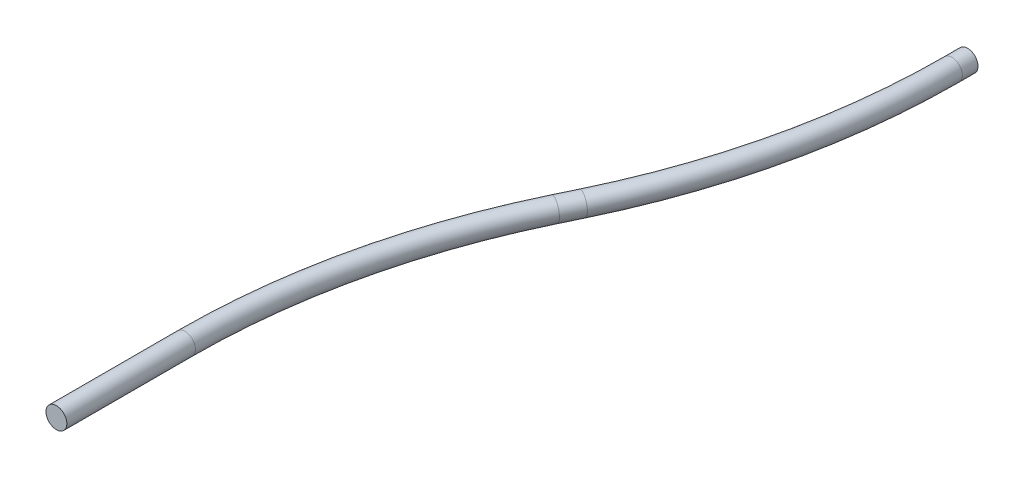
ISO-10303-21;
HEADER;
FILE_DESCRIPTION(('STEP AP214'),'2;1');
FILE_NAME('part.step','',(''),(''),'','','');
FILE_SCHEMA(('AUTOMOTIVE_DESIGN { 1 0 10303 214 1 1 1 1 }'));
ENDSEC;
DATA;
#1=APPLICATION_CONTEXT('core data for automotive mechanical design processes');
#2=APPLICATION_PROTOCOL_DEFINITION('international standard','automotive_design',2000,#1);
#3=PRODUCT_CONTEXT('',#1,'mechanical');
#4=PRODUCT('Part','Part','',(#3));
#5=PRODUCT_RELATED_PRODUCT_CATEGORY('part','',(#4));
#6=PRODUCT_DEFINITION_FORMATION('','',#4);
#7=PRODUCT_DEFINITION_CONTEXT('part definition',#1,'design');
#8=PRODUCT_DEFINITION('design','',#6,#7);
#9=PRODUCT_DEFINITION_SHAPE('','',#8);
#10=(LENGTH_UNIT() NAMED_UNIT(*) SI_UNIT(.MILLI.,.METRE.));
#11=(NAMED_UNIT(*) PLANE_ANGLE_UNIT() SI_UNIT($,.RADIAN.));
#12=(NAMED_UNIT(*) SI_UNIT($,.STERADIAN.) SOLID_ANGLE_UNIT());
#13=UNCERTAINTY_MEASURE_WITH_UNIT(LENGTH_MEASURE(1.E-05),#10,'distance_accuracy_value','');
#14=(GEOMETRIC_REPRESENTATION_CONTEXT(3) GLOBAL_UNCERTAINTY_ASSIGNED_CONTEXT((#13)) GLOBAL_UNIT_ASSIGNED_CONTEXT((#10,
#11,#12)) REPRESENTATION_CONTEXT('',''));
#15=CARTESIAN_POINT('',(0.,0.,0.));
#16=DIRECTION('',(0.,0.,1.));
#17=DIRECTION('',(1.,0.,0.));
#18=AXIS2_PLACEMENT_3D('',#15,#16,#17);
#19=CARTESIAN_POINT('',(21.336,0.,-109.481190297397));
#20=DIRECTION('',(0.,0.,-1.));
#21=DIRECTION('',(-1.,0.,0.));
#22=AXIS2_PLACEMENT_3D('',#19,#20,#21);
#23=CYLINDRICAL_SURFACE('',#22,1.524);
#24=CARTESIAN_POINT('',(21.336,0.,-109.481190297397));
#25=DIRECTION('',(0.,0.,1.));
#26=DIRECTION('',(1.,0.,0.));
#27=AXIS2_PLACEMENT_3D('',#24,#25,#26);
#28=CIRCLE('',#27,1.524);
#29=CARTESIAN_POINT('',(22.8599999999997,0.,-109.481190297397));
#30=VERTEX_POINT('',#29);
#31=EDGE_CURVE('E34',#30,#30,#28,.T.);
#32=ORIENTED_EDGE('',*,*,#31,.F.);
#33=EDGE_LOOP('',(#32));
#34=FACE_BOUND('',#33,.T.);
#35=CARTESIAN_POINT('',(21.336,0.,-111.76));
#36=DIRECTION('',(0.,0.,1.));
#37=DIRECTION('',(1.,0.,0.));
#38=AXIS2_PLACEMENT_3D('',#35,#36,#37);
#39=CIRCLE('',#38,1.524);
#40=CARTESIAN_POINT('',(22.86,0.,-111.76));
#41=VERTEX_POINT('',#40);
#42=EDGE_CURVE('E10',#41,#41,#39,.T.);
#43=ORIENTED_EDGE('',*,*,#42,.T.);
#44=EDGE_LOOP('',(#43));
#45=FACE_BOUND('',#44,.T.);
#46=ADVANCED_FACE('F28',(#34,#45),#23,.T.);
#47=CARTESIAN_POINT('',(-80.2640000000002,0.,-109.481190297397));
#48=DIRECTION('',(0.,1.,0.));
#49=DIRECTION('',(0.,0.,1.));
#50=AXIS2_PLACEMENT_3D('',#47,#48,#49);
#51=TOROIDAL_SURFACE('',#50,101.6,1.524);
#52=CARTESIAN_POINT('',(11.3307426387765,0.,-65.5157138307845));
#53=DIRECTION('',(-0.432731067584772,0.,0.901523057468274));
#54=DIRECTION('',(0.901523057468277,0.,0.432731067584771));
#55=AXIS2_PLACEMENT_3D('',#52,#53,#54);
#56=CIRCLE('',#55,1.524);
#57=CARTESIAN_POINT('',(12.704663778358,0.,-64.8562316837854));
#58=VERTEX_POINT('',#57);
#59=EDGE_CURVE('E38',#58,#58,#56,.T.);
#60=CARTESIAN_POINT('',(-80.2640000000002,0.,-109.481190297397));
#61=DIRECTION('',(0.,1.,0.));
#62=DIRECTION('',(0.,0.,1.));
#63=AXIS2_PLACEMENT_3D('',#60,#61,#62);
#64=CIRCLE('',#63,103.124);
#65=EDGE_CURVE('',#58,#30,#64,.T.);
#66=ORIENTED_EDGE('',*,*,#59,.F.);
#67=ORIENTED_EDGE('',*,*,#31,.T.);
#68=ORIENTED_EDGE('',*,*,#65,.T.);
#69=ORIENTED_EDGE('',*,*,#65,.F.);
#70=EDGE_LOOP('',(#66,#68,#67,#69));
#71=FACE_BOUND('',#70,.T.);
#72=ADVANCED_FACE('F66',(#71),#51,.T.);
#73=CARTESIAN_POINT('',(10.0052573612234,0.,-62.7542861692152));
#74=DIRECTION('',(0.432731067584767,0.,-0.901523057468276));
#75=DIRECTION('',(-0.901523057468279,0.,-0.432731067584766));
#76=AXIS2_PLACEMENT_3D('',#73,#74,#75);
#77=CYLINDRICAL_SURFACE('',#76,1.524);
#78=CARTESIAN_POINT('',(10.0052573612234,0.,-62.7542861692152));
#79=DIRECTION('',(-0.432731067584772,0.,0.901523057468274));
#80=DIRECTION('',(0.901523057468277,0.,0.432731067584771));
#81=AXIS2_PLACEMENT_3D('',#78,#79,#80);
#82=CIRCLE('',#81,1.524);
#83=CARTESIAN_POINT('',(8.63133622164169,0.,-63.4137683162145));
#84=VERTEX_POINT('',#83);
#85=EDGE_CURVE('E42',#84,#84,#82,.T.);
#86=ORIENTED_EDGE('',*,*,#85,.F.);
#87=EDGE_LOOP('',(#86));
#88=FACE_BOUND('',#87,.T.);
#89=ORIENTED_EDGE('',*,*,#59,.T.);
#90=EDGE_LOOP('',(#89));
#91=FACE_BOUND('',#90,.T.);
#92=ADVANCED_FACE('F60',(#88,#91),#77,.T.);
#93=CARTESIAN_POINT('',(101.6,-1.52655665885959E-13,-18.7888097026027));
#94=DIRECTION('',(0.,-1.,0.));
#95=DIRECTION('',(0.,0.,-1.));
#96=AXIS2_PLACEMENT_3D('',#93,#94,#95);
#97=TOROIDAL_SURFACE('',#96,101.6,1.524);
#98=CARTESIAN_POINT('',(0.,0.,-18.7888097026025));
#99=DIRECTION('',(0.,0.,1.));
#100=DIRECTION('',(1.,0.,0.));
#101=AXIS2_PLACEMENT_3D('',#98,#99,#100);
#102=CIRCLE('',#101,1.524);
#103=CARTESIAN_POINT('',(-1.52399999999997,0.,-18.7888097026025));
#104=VERTEX_POINT('',#103);
#105=EDGE_CURVE('E47',#104,#104,#102,.T.);
#106=CARTESIAN_POINT('',(101.6,-1.52655665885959E-13,-18.7888097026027));
#107=DIRECTION('',(0.,-1.,0.));
#108=DIRECTION('',(0.,0.,-1.));
#109=AXIS2_PLACEMENT_3D('',#106,#107,#108);
#110=CIRCLE('',#109,103.124);
#111=EDGE_CURVE('',#104,#84,#110,.T.);
#112=ORIENTED_EDGE('',*,*,#105,.F.);
#113=ORIENTED_EDGE('',*,*,#85,.T.);
#114=ORIENTED_EDGE('',*,*,#111,.T.);
#115=ORIENTED_EDGE('',*,*,#111,.F.);
#116=EDGE_LOOP('',(#112,#114,#113,#115));
#117=FACE_BOUND('',#116,.T.);
#118=ADVANCED_FACE('F57',(#117),#97,.T.);
#119=CARTESIAN_POINT('',(0.,0.,-18.7888097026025));
#120=DIRECTION('',(0.,0.,1.));
#121=DIRECTION('',(1.,0.,0.));
#122=AXIS2_PLACEMENT_3D('',#119,#120,#121);
#123=CYLINDRICAL_SURFACE('',#122,1.524);
#124=ORIENTED_EDGE('',*,*,#105,.T.);
#125=EDGE_LOOP('',(#124));
#126=FACE_BOUND('',#125,.T.);
#127=CARTESIAN_POINT('',(0.,0.,2.23779328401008E-13));
#128=DIRECTION('',(0.,0.,1.));
#129=DIRECTION('',(1.,0.,0.));
#130=AXIS2_PLACEMENT_3D('',#127,#128,#129);
#131=CIRCLE('',#130,1.524);
#132=CARTESIAN_POINT('',(1.524,0.,2.23779328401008E-13));
#133=VERTEX_POINT('',#132);
#134=EDGE_CURVE('E48',#133,#133,#131,.T.);
#135=ORIENTED_EDGE('',*,*,#134,.F.);
#136=EDGE_LOOP('',(#135));
#137=FACE_BOUND('',#136,.T.);
#138=ADVANCED_FACE('F54',(#126,#137),#123,.T.);
#139=CARTESIAN_POINT('',(21.336,0.,-111.76));
#140=DIRECTION('',(0.,0.,1.));
#141=DIRECTION('',(1.,0.,0.));
#142=AXIS2_PLACEMENT_3D('',#139,#140,#141);
#143=PLANE('',#142);
#144=ORIENTED_EDGE('',*,*,#42,.F.);
#145=EDGE_LOOP('',(#144));
#146=FACE_BOUND('',#145,.T.);
#147=ADVANCED_FACE('F78',(#146),#143,.F.);
#148=CARTESIAN_POINT('',(0.,0.,2.23779328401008E-13));
#149=DIRECTION('',(0.,0.,1.));
#150=DIRECTION('',(1.,0.,0.));
#151=AXIS2_PLACEMENT_3D('',#148,#149,#150);
#152=PLANE('',#151);
#153=ORIENTED_EDGE('',*,*,#134,.T.);
#154=EDGE_LOOP('',(#153));
#155=FACE_BOUND('',#154,.T.);
#156=ADVANCED_FACE('F79',(#155),#152,.T.);
#157=CLOSED_SHELL('',(#46,#72,#92,#118,#138,#147,#156));
#158=MANIFOLD_SOLID_BREP('B2',#157);
#159=ADVANCED_BREP_SHAPE_REPRESENTATION('',(#18,#158),#14);
#160=SHAPE_DEFINITION_REPRESENTATION(#9,#159);
ENDSEC;
END-ISO-10303-21;
